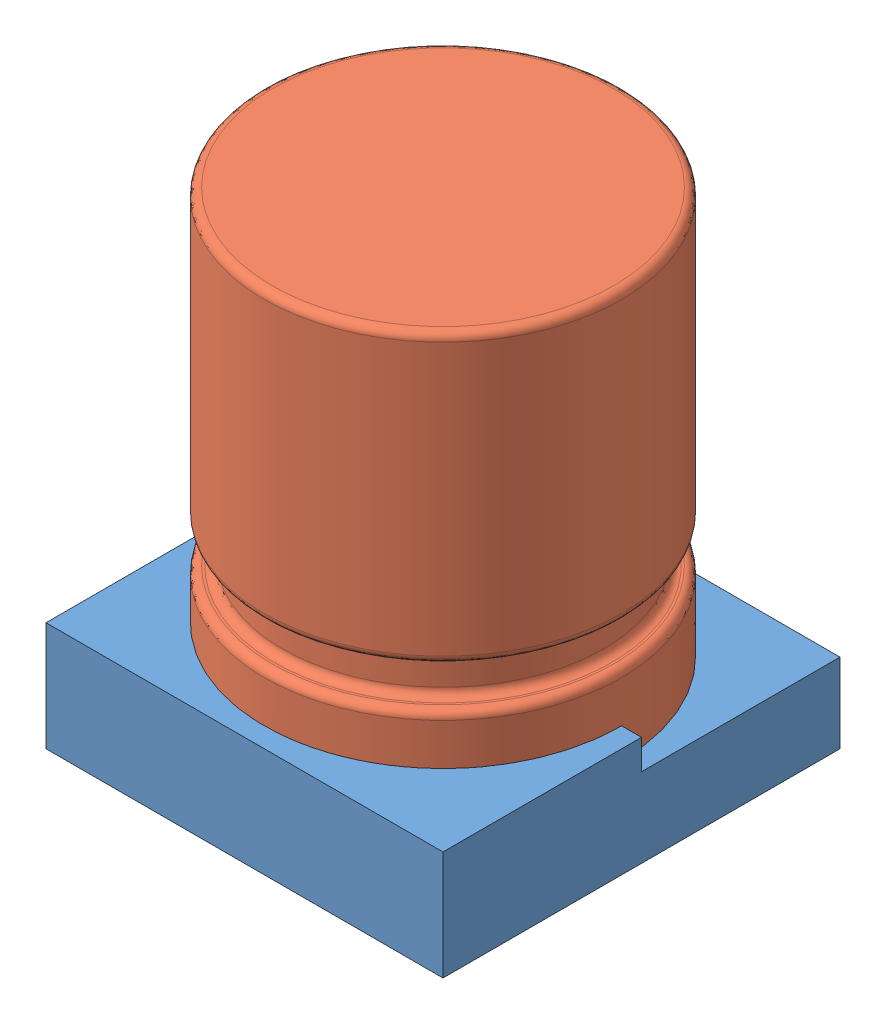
SolidWorks assembly Ensamblaje2.sldasm, configuration Predeterminado (file format 6000). Lengths in mm.
Overall size (4.15 4.9 4.15).
2 component instances, 2 part files, 2 mates.
Components (placement in the parent):
- base-1: base.SLDPRT [Predeterminado] at (-2.2024 -0.8597 2) size (4 1.1 4)
- cap-1: cap.SLDPRT [Predeterminado] at (-0.2024 -0.0597 4) x (0.986175 0 -0.165705) z (0.165705 0 0.986175) size (3.6 4.1 3.6)
Mates (geometry in assembly coordinates):
- Coincidente1: coincident anti-aligned: plane of base-1 through (-0.2024 -0.0597 4) normal (0 1 0); plane of cap-1 through (-0.2024 -0.0597 4) normal (0 -1 0)
- Concéntrica1: concentric anti-aligned: cylinder of base-1 through (-0.2024 -0.0597 4) axis (0 1 0) radius 1.8; cylinder of cap-1 through (-0.2024 0.7403 4) axis (0 -1 0) radius 1.8
